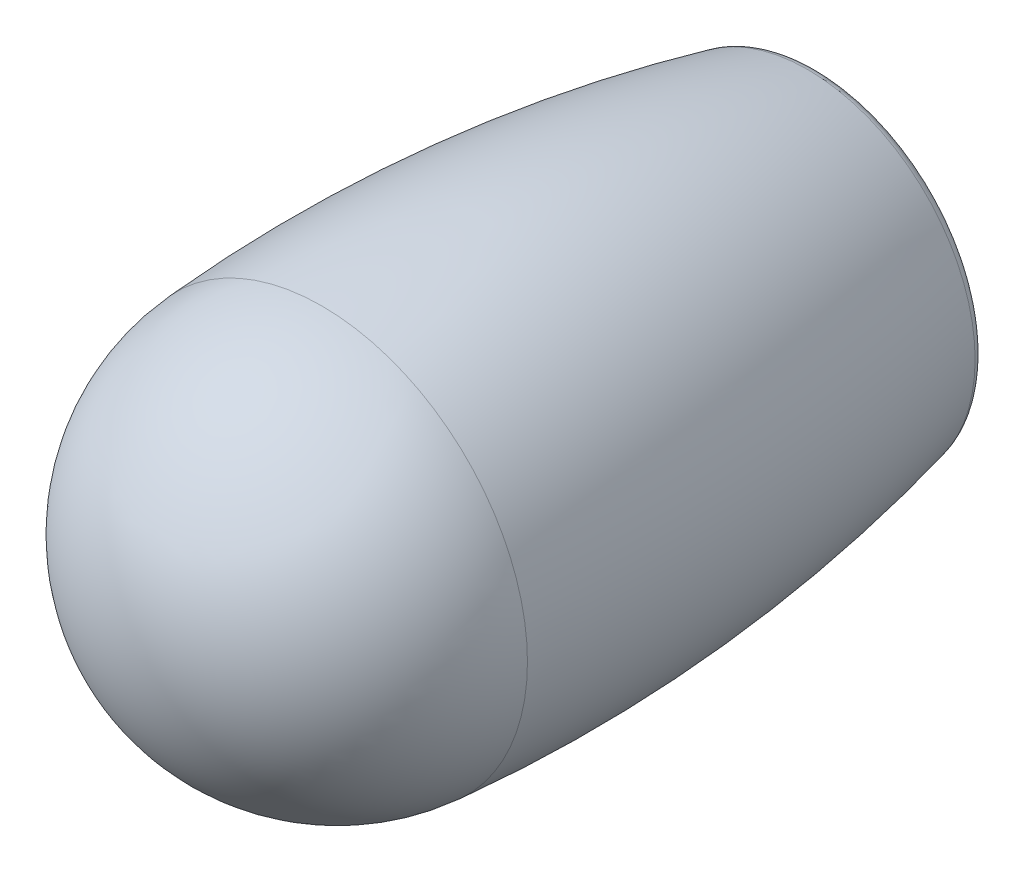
ISO-10303-21;
HEADER;
FILE_DESCRIPTION(('STEP AP214'),'2;1');
FILE_NAME('part.step','',(''),(''),'','','');
FILE_SCHEMA(('AUTOMOTIVE_DESIGN { 1 0 10303 214 1 1 1 1 }'));
ENDSEC;
DATA;
#1=APPLICATION_CONTEXT('core data for automotive mechanical design processes');
#2=APPLICATION_PROTOCOL_DEFINITION('international standard','automotive_design',2000,#1);
#3=PRODUCT_CONTEXT('',#1,'mechanical');
#4=PRODUCT('Part','Part','',(#3));
#5=PRODUCT_RELATED_PRODUCT_CATEGORY('part','',(#4));
#6=PRODUCT_DEFINITION_FORMATION('','',#4);
#7=PRODUCT_DEFINITION_CONTEXT('part definition',#1,'design');
#8=PRODUCT_DEFINITION('design','',#6,#7);
#9=PRODUCT_DEFINITION_SHAPE('','',#8);
#10=(LENGTH_UNIT() NAMED_UNIT(*) SI_UNIT(.MILLI.,.METRE.));
#11=(NAMED_UNIT(*) PLANE_ANGLE_UNIT() SI_UNIT($,.RADIAN.));
#12=(NAMED_UNIT(*) SI_UNIT($,.STERADIAN.) SOLID_ANGLE_UNIT());
#13=UNCERTAINTY_MEASURE_WITH_UNIT(LENGTH_MEASURE(1.E-05),#10,'distance_accuracy_value','');
#14=(GEOMETRIC_REPRESENTATION_CONTEXT(3) GLOBAL_UNCERTAINTY_ASSIGNED_CONTEXT((#13)) GLOBAL_UNIT_ASSIGNED_CONTEXT((#10,
#11,#12)) REPRESENTATION_CONTEXT('',''));
#15=CARTESIAN_POINT('',(0.,0.,0.));
#16=DIRECTION('',(0.,0.,1.));
#17=DIRECTION('',(1.,0.,0.));
#18=AXIS2_PLACEMENT_3D('',#15,#16,#17);
#19=CARTESIAN_POINT('',(0.,0.,0.));
#20=DIRECTION('',(0.,0.,-1.));
#21=DIRECTION('',(-1.,0.,0.));
#22=AXIS2_PLACEMENT_3D('',#19,#20,#21);
#23=PLANE('',#22);
#24=CARTESIAN_POINT('',(0.,0.,0.));
#25=DIRECTION('',(0.,0.,-1.));
#26=DIRECTION('',(-1.,0.,0.));
#27=AXIS2_PLACEMENT_3D('',#24,#25,#26);
#28=CIRCLE('',#27,5.60564600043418);
#29=CARTESIAN_POINT('',(-5.60564600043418,0.,0.));
#30=VERTEX_POINT('',#29);
#31=EDGE_CURVE('E19',#30,#30,#28,.T.);
#32=ORIENTED_EDGE('',*,*,#31,.T.);
#33=EDGE_LOOP('',(#32));
#34=FACE_BOUND('',#33,.T.);
#35=CARTESIAN_POINT('',(0.,0.,0.));
#36=DIRECTION('',(0.,0.,-1.));
#37=DIRECTION('',(-1.,0.,0.));
#38=AXIS2_PLACEMENT_3D('',#35,#36,#37);
#39=CIRCLE('',#38,3.);
#40=CARTESIAN_POINT('',(-3.,0.,0.));
#41=VERTEX_POINT('',#40);
#42=EDGE_CURVE('E32',#41,#41,#39,.T.);
#43=ORIENTED_EDGE('',*,*,#42,.F.);
#44=EDGE_LOOP('',(#43));
#45=FACE_BOUND('',#44,.T.);
#46=ADVANCED_FACE('F12',(#34,#45),#23,.T.);
#47=CARTESIAN_POINT('',(0.,0.,13.706073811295));
#48=DIRECTION('',(0.,0.,-1.));
#49=DIRECTION('',(-1.,0.,0.));
#50=AXIS2_PLACEMENT_3D('',#47,#48,#49);
#51=DEGENERATE_TOROIDAL_SURFACE('',#50,50.3572847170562,58.,.F.);
#52=CARTESIAN_POINT('',(0.,0.,0.385164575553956));
#53=DIRECTION('',(0.,0.,1.));
#54=DIRECTION('',(1.,0.,0.));
#55=AXIS2_PLACEMENT_3D('',#52,#53,#54);
#56=CIRCLE('',#55,6.09228018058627);
#57=CARTESIAN_POINT('',(6.09228018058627,0.,0.385164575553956));
#58=VERTEX_POINT('',#57);
#59=EDGE_CURVE('E8',#58,#58,#56,.T.);
#60=ORIENTED_EDGE('',*,*,#59,.T.);
#61=EDGE_LOOP('',(#60));
#62=FACE_BOUND('',#61,.T.);
#63=CARTESIAN_POINT('',(0.,0.,18.0634543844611));
#64=DIRECTION('',(0.,0.,-1.));
#65=DIRECTION('',(-1.,0.,0.));
#66=AXIS2_PLACEMENT_3D('',#63,#64,#65);
#67=CIRCLE('',#66,7.47880466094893);
#68=CARTESIAN_POINT('',(-7.47880466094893,0.,18.0634543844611));
#69=VERTEX_POINT('',#68);
#70=EDGE_CURVE('E23',#69,#69,#67,.T.);
#71=ORIENTED_EDGE('',*,*,#70,.T.);
#72=EDGE_LOOP('',(#71));
#73=FACE_BOUND('',#72,.T.);
#74=ADVANCED_FACE('F59',(#62,#73),#51,.F.);
#75=CARTESIAN_POINT('',(0.,0.,17.5));
#76=DIRECTION('',(0.,0.,-1.));
#77=DIRECTION('',(0.,1.,0.));
#78=AXIS2_PLACEMENT_3D('',#75,#76,#77);
#79=SPHERICAL_SURFACE('',#78,7.5);
#80=ORIENTED_EDGE('',*,*,#70,.F.);
#81=EDGE_LOOP('',(#80));
#82=FACE_BOUND('',#81,.T.);
#83=ADVANCED_FACE('F63',(#82),#79,.T.);
#84=CARTESIAN_POINT('',(0.,0.,14.));
#85=DIRECTION('',(0.,0.,-1.));
#86=DIRECTION('',(-1.,0.,0.));
#87=AXIS2_PLACEMENT_3D('',#84,#85,#86);
#88=CYLINDRICAL_SURFACE('',#87,3.);
#89=ORIENTED_EDGE('',*,*,#42,.T.);
#90=EDGE_LOOP('',(#89));
#91=FACE_BOUND('',#90,.T.);
#92=CARTESIAN_POINT('',(0.,0.,17.));
#93=DIRECTION('',(0.,0.,-1.));
#94=DIRECTION('',(-1.,0.,0.));
#95=AXIS2_PLACEMENT_3D('',#92,#93,#94);
#96=CIRCLE('',#95,3.);
#97=CARTESIAN_POINT('',(-3.,0.,17.));
#98=VERTEX_POINT('',#97);
#99=EDGE_CURVE('E27',#98,#98,#96,.T.);
#100=ORIENTED_EDGE('',*,*,#99,.F.);
#101=EDGE_LOOP('',(#100));
#102=FACE_BOUND('',#101,.T.);
#103=ADVANCED_FACE('F55',(#91,#102),#88,.F.);
#104=CARTESIAN_POINT('',(0.,0.,17.));
#105=DIRECTION('',(0.,0.,-1.));
#106=DIRECTION('',(-1.,0.,0.));
#107=AXIS2_PLACEMENT_3D('',#104,#105,#106);
#108=PLANE('',#107);
#109=CARTESIAN_POINT('',(0.,0.,17.));
#110=DIRECTION('',(0.,0.,-1.));
#111=DIRECTION('',(-1.,0.,0.));
#112=AXIS2_PLACEMENT_3D('',#109,#110,#111);
#113=CIRCLE('',#112,2.);
#114=CARTESIAN_POINT('',(-2.,0.,17.));
#115=VERTEX_POINT('',#114);
#116=EDGE_CURVE('E30',#115,#115,#113,.T.);
#117=ORIENTED_EDGE('',*,*,#116,.F.);
#118=EDGE_LOOP('',(#117));
#119=FACE_BOUND('',#118,.T.);
#120=ORIENTED_EDGE('',*,*,#99,.T.);
#121=EDGE_LOOP('',(#120));
#122=FACE_BOUND('',#121,.T.);
#123=ADVANCED_FACE('F46',(#119,#122),#108,.T.);
#124=CARTESIAN_POINT('',(0.,0.,22.));
#125=DIRECTION('',(0.,0.,-1.));
#126=DIRECTION('',(-1.,0.,0.));
#127=AXIS2_PLACEMENT_3D('',#124,#125,#126);
#128=CYLINDRICAL_SURFACE('',#127,2.);
#129=ORIENTED_EDGE('',*,*,#116,.T.);
#130=EDGE_LOOP('',(#129));
#131=FACE_BOUND('',#130,.T.);
#132=CARTESIAN_POINT('',(0.,0.,22.));
#133=DIRECTION('',(0.,0.,-1.));
#134=DIRECTION('',(-1.,0.,0.));
#135=AXIS2_PLACEMENT_3D('',#132,#133,#134);
#136=CIRCLE('',#135,2.);
#137=CARTESIAN_POINT('',(-2.,0.,22.));
#138=VERTEX_POINT('',#137);
#139=EDGE_CURVE('E33',#138,#138,#136,.T.);
#140=ORIENTED_EDGE('',*,*,#139,.F.);
#141=EDGE_LOOP('',(#140));
#142=FACE_BOUND('',#141,.T.);
#143=ADVANCED_FACE('F44',(#131,#142),#128,.F.);
#144=CARTESIAN_POINT('',(0.,0.,22.));
#145=DIRECTION('',(0.,0.,-1.));
#146=DIRECTION('',(-1.,0.,0.));
#147=AXIS2_PLACEMENT_3D('',#144,#145,#146);
#148=PLANE('',#147);
#149=ORIENTED_EDGE('',*,*,#139,.T.);
#150=EDGE_LOOP('',(#149));
#151=FACE_BOUND('',#150,.T.);
#152=ADVANCED_FACE('F42',(#151),#148,.T.);
#153=CARTESIAN_POINT('',(0.,0.,0.5));
#154=DIRECTION('',(0.,0.,-1.));
#155=DIRECTION('',(-1.,0.,0.));
#156=AXIS2_PLACEMENT_3D('',#153,#154,#155);
#157=TOROIDAL_SURFACE('',#156,5.60564600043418,0.5);
#158=ORIENTED_EDGE('',*,*,#59,.F.);
#159=EDGE_LOOP('',(#158));
#160=FACE_BOUND('',#159,.T.);
#161=ORIENTED_EDGE('',*,*,#31,.F.);
#162=EDGE_LOOP('',(#161));
#163=FACE_BOUND('',#162,.T.);
#164=ADVANCED_FACE('F14',(#160,#163),#157,.T.);
#165=CLOSED_SHELL('',(#46,#74,#83,#103,#123,#143,#152,#164));
#166=MANIFOLD_SOLID_BREP('B1',#165);
#167=ADVANCED_BREP_SHAPE_REPRESENTATION('',(#18,#166),#14);
#168=SHAPE_DEFINITION_REPRESENTATION(#9,#167);
ENDSEC;
END-ISO-10303-21;
